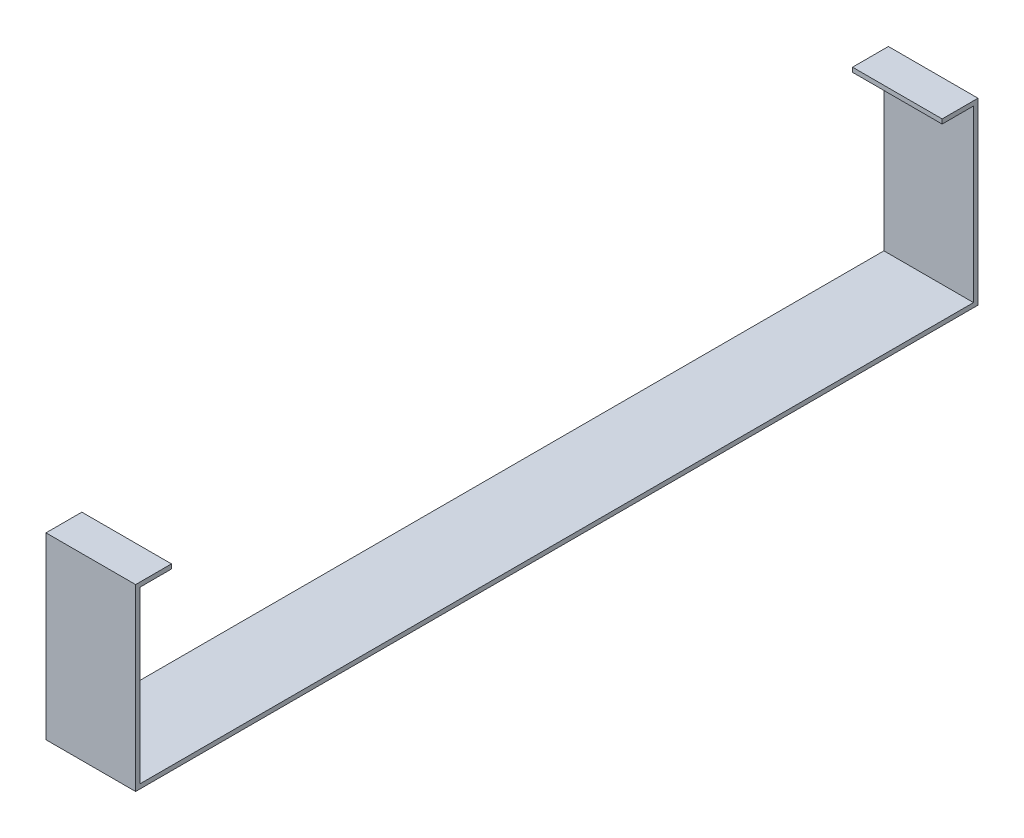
ISO-10303-21;
HEADER;
FILE_DESCRIPTION(('STEP AP214'),'2;1');
FILE_NAME('part.step','',(''),(''),'','','');
FILE_SCHEMA(('AUTOMOTIVE_DESIGN { 1 0 10303 214 1 1 1 1 }'));
ENDSEC;
DATA;
#1=APPLICATION_CONTEXT('core data for automotive mechanical design processes');
#2=APPLICATION_PROTOCOL_DEFINITION('international standard','automotive_design',2000,#1);
#3=PRODUCT_CONTEXT('',#1,'mechanical');
#4=PRODUCT('Part','Part','',(#3));
#5=PRODUCT_RELATED_PRODUCT_CATEGORY('part','',(#4));
#6=PRODUCT_DEFINITION_FORMATION('','',#4);
#7=PRODUCT_DEFINITION_CONTEXT('part definition',#1,'design');
#8=PRODUCT_DEFINITION('design','',#6,#7);
#9=PRODUCT_DEFINITION_SHAPE('','',#8);
#10=(LENGTH_UNIT() NAMED_UNIT(*) SI_UNIT(.MILLI.,.METRE.));
#11=(NAMED_UNIT(*) PLANE_ANGLE_UNIT() SI_UNIT($,.RADIAN.));
#12=(NAMED_UNIT(*) SI_UNIT($,.STERADIAN.) SOLID_ANGLE_UNIT());
#13=UNCERTAINTY_MEASURE_WITH_UNIT(LENGTH_MEASURE(1.E-05),#10,'distance_accuracy_value','');
#14=(GEOMETRIC_REPRESENTATION_CONTEXT(3) GLOBAL_UNCERTAINTY_ASSIGNED_CONTEXT((#13)) GLOBAL_UNIT_ASSIGNED_CONTEXT((#10,
#11,#12)) REPRESENTATION_CONTEXT('',''));
#15=CARTESIAN_POINT('',(0.,0.,0.));
#16=DIRECTION('',(0.,0.,1.));
#17=DIRECTION('',(1.,0.,0.));
#18=AXIS2_PLACEMENT_3D('',#15,#16,#17);
#19=CARTESIAN_POINT('',(-90.,0.,-846.));
#20=DIRECTION('',(0.,-1.,0.));
#21=DIRECTION('',(0.,0.,-1.));
#22=AXIS2_PLACEMENT_3D('',#19,#20,#21);
#23=PLANE('',#22);
#24=DIRECTION('',(0.,0.,-1.));
#25=VECTOR('',#24,1.);
#26=CARTESIAN_POINT('',(0.,0.,-846.));
#27=LINE('',#26,#25);
#28=CARTESIAN_POINT('',(0.,0.,0.));
#29=VERTEX_POINT('',#28);
#30=CARTESIAN_POINT('',(0.,0.,-846.));
#31=VERTEX_POINT('',#30);
#32=EDGE_CURVE('E153',#29,#31,#27,.T.);
#33=ORIENTED_EDGE('',*,*,#32,.F.);
#34=DIRECTION('',(1.,0.,0.));
#35=VECTOR('',#34,1.);
#36=CARTESIAN_POINT('',(-90.,0.,0.));
#37=LINE('',#36,#35);
#38=CARTESIAN_POINT('',(-90.,0.,0.));
#39=VERTEX_POINT('',#38);
#40=EDGE_CURVE('E11',#39,#29,#37,.T.);
#41=ORIENTED_EDGE('',*,*,#40,.F.);
#42=DIRECTION('',(0.,0.,-1.));
#43=VECTOR('',#42,1.);
#44=CARTESIAN_POINT('',(-90.,0.,-846.));
#45=LINE('',#44,#43);
#46=CARTESIAN_POINT('',(-90.,0.,-846.));
#47=VERTEX_POINT('',#46);
#48=EDGE_CURVE('E185',#39,#47,#45,.T.);
#49=ORIENTED_EDGE('',*,*,#48,.T.);
#50=DIRECTION('',(1.,0.,0.));
#51=VECTOR('',#50,1.);
#52=CARTESIAN_POINT('',(-90.,0.,-846.));
#53=LINE('',#52,#51);
#54=EDGE_CURVE('E35',#47,#31,#53,.T.);
#55=ORIENTED_EDGE('',*,*,#54,.T.);
#56=EDGE_LOOP('',(#33,#41,#49,#55));
#57=FACE_BOUND('',#56,.T.);
#58=ADVANCED_FACE('F32',(#57),#23,.T.);
#59=CARTESIAN_POINT('',(-90.,0.,0.));
#60=DIRECTION('',(0.,0.,1.));
#61=DIRECTION('',(1.,0.,0.));
#62=AXIS2_PLACEMENT_3D('',#59,#60,#61);
#63=PLANE('',#62);
#64=DIRECTION('',(0.,-1.,0.));
#65=VECTOR('',#64,1.);
#66=CARTESIAN_POINT('',(0.,0.,0.));
#67=LINE('',#66,#65);
#68=CARTESIAN_POINT('',(0.,180.,0.));
#69=VERTEX_POINT('',#68);
#70=EDGE_CURVE('E183',#69,#29,#67,.T.);
#71=ORIENTED_EDGE('',*,*,#70,.F.);
#72=DIRECTION('',(1.,0.,0.));
#73=VECTOR('',#72,1.);
#74=CARTESIAN_POINT('',(-90.,180.,0.));
#75=LINE('',#74,#73);
#76=CARTESIAN_POINT('',(-90.,180.,0.));
#77=VERTEX_POINT('',#76);
#78=EDGE_CURVE('E41',#77,#69,#75,.T.);
#79=ORIENTED_EDGE('',*,*,#78,.F.);
#80=DIRECTION('',(0.,-1.,0.));
#81=VECTOR('',#80,1.);
#82=CARTESIAN_POINT('',(-90.,0.,0.));
#83=LINE('',#82,#81);
#84=EDGE_CURVE('E143',#77,#39,#83,.T.);
#85=ORIENTED_EDGE('',*,*,#84,.T.);
#86=ORIENTED_EDGE('',*,*,#40,.T.);
#87=EDGE_LOOP('',(#71,#79,#85,#86));
#88=FACE_BOUND('',#87,.T.);
#89=ADVANCED_FACE('F205',(#88),#63,.T.);
#90=CARTESIAN_POINT('',(-90.,180.,0.));
#91=DIRECTION('',(0.,1.,0.));
#92=DIRECTION('',(0.,0.,1.));
#93=AXIS2_PLACEMENT_3D('',#90,#91,#92);
#94=PLANE('',#93);
#95=DIRECTION('',(0.,0.,1.));
#96=VECTOR('',#95,1.);
#97=CARTESIAN_POINT('',(0.,180.,0.));
#98=LINE('',#97,#96);
#99=CARTESIAN_POINT('',(0.,180.,-36.));
#100=VERTEX_POINT('',#99);
#101=EDGE_CURVE('E130',#100,#69,#98,.T.);
#102=ORIENTED_EDGE('',*,*,#101,.F.);
#103=DIRECTION('',(1.,0.,0.));
#104=VECTOR('',#103,1.);
#105=CARTESIAN_POINT('',(-90.,180.,-36.));
#106=LINE('',#105,#104);
#107=CARTESIAN_POINT('',(-90.,180.,-36.));
#108=VERTEX_POINT('',#107);
#109=EDGE_CURVE('E125',#108,#100,#106,.T.);
#110=ORIENTED_EDGE('',*,*,#109,.F.);
#111=DIRECTION('',(0.,0.,1.));
#112=VECTOR('',#111,1.);
#113=CARTESIAN_POINT('',(-90.,180.,0.));
#114=LINE('',#113,#112);
#115=EDGE_CURVE('E128',#108,#77,#114,.T.);
#116=ORIENTED_EDGE('',*,*,#115,.T.);
#117=ORIENTED_EDGE('',*,*,#78,.T.);
#118=EDGE_LOOP('',(#102,#110,#116,#117));
#119=FACE_BOUND('',#118,.T.);
#120=ADVANCED_FACE('F127',(#119),#94,.T.);
#121=CARTESIAN_POINT('',(-90.,180.,-36.));
#122=DIRECTION('',(0.,0.,-1.));
#123=DIRECTION('',(-1.,0.,0.));
#124=AXIS2_PLACEMENT_3D('',#121,#122,#123);
#125=PLANE('',#124);
#126=DIRECTION('',(0.,1.,0.));
#127=VECTOR('',#126,1.);
#128=CARTESIAN_POINT('',(0.,180.,-36.));
#129=LINE('',#128,#127);
#130=CARTESIAN_POINT('',(0.,175.5,-36.));
#131=VERTEX_POINT('',#130);
#132=EDGE_CURVE('E180',#131,#100,#129,.T.);
#133=ORIENTED_EDGE('',*,*,#132,.F.);
#134=DIRECTION('',(1.,0.,0.));
#135=VECTOR('',#134,1.);
#136=CARTESIAN_POINT('',(-90.,175.5,-36.));
#137=LINE('',#136,#135);
#138=CARTESIAN_POINT('',(-90.,175.5,-36.));
#139=VERTEX_POINT('',#138);
#140=EDGE_CURVE('E135',#139,#131,#137,.T.);
#141=ORIENTED_EDGE('',*,*,#140,.F.);
#142=DIRECTION('',(0.,1.,0.));
#143=VECTOR('',#142,1.);
#144=CARTESIAN_POINT('',(-90.,180.,-36.));
#145=LINE('',#144,#143);
#146=EDGE_CURVE('E141',#139,#108,#145,.T.);
#147=ORIENTED_EDGE('',*,*,#146,.T.);
#148=ORIENTED_EDGE('',*,*,#109,.T.);
#149=EDGE_LOOP('',(#133,#141,#147,#148));
#150=FACE_BOUND('',#149,.T.);
#151=ADVANCED_FACE('F145',(#150),#125,.T.);
#152=CARTESIAN_POINT('',(-90.,175.5,-36.));
#153=DIRECTION('',(0.,-1.,0.));
#154=DIRECTION('',(0.,0.,-1.));
#155=AXIS2_PLACEMENT_3D('',#152,#153,#154);
#156=PLANE('',#155);
#157=DIRECTION('',(0.,0.,-1.));
#158=VECTOR('',#157,1.);
#159=CARTESIAN_POINT('',(0.,175.5,-36.));
#160=LINE('',#159,#158);
#161=CARTESIAN_POINT('',(0.,175.5,-4.5));
#162=VERTEX_POINT('',#161);
#163=EDGE_CURVE('E177',#162,#131,#160,.T.);
#164=ORIENTED_EDGE('',*,*,#163,.F.);
#165=DIRECTION('',(1.,0.,0.));
#166=VECTOR('',#165,1.);
#167=CARTESIAN_POINT('',(-90.,175.5,-4.5));
#168=LINE('',#167,#166);
#169=CARTESIAN_POINT('',(-90.,175.5,-4.5));
#170=VERTEX_POINT('',#169);
#171=EDGE_CURVE('E189',#170,#162,#168,.T.);
#172=ORIENTED_EDGE('',*,*,#171,.F.);
#173=DIRECTION('',(0.,0.,-1.));
#174=VECTOR('',#173,1.);
#175=CARTESIAN_POINT('',(-90.,175.5,-36.));
#176=LINE('',#175,#174);
#177=EDGE_CURVE('E146',#170,#139,#176,.T.);
#178=ORIENTED_EDGE('',*,*,#177,.T.);
#179=ORIENTED_EDGE('',*,*,#140,.T.);
#180=EDGE_LOOP('',(#164,#172,#178,#179));
#181=FACE_BOUND('',#180,.T.);
#182=ADVANCED_FACE('F218',(#181),#156,.T.);
#183=CARTESIAN_POINT('',(-90.,175.5,-4.5));
#184=DIRECTION('',(0.,0.,-1.));
#185=DIRECTION('',(0.,1.,0.));
#186=AXIS2_PLACEMENT_3D('',#183,#184,#185);
#187=PLANE('',#186);
#188=DIRECTION('',(0.,1.,0.));
#189=VECTOR('',#188,1.);
#190=CARTESIAN_POINT('',(0.,175.5,-4.5));
#191=LINE('',#190,#189);
#192=CARTESIAN_POINT('',(0.,4.49999999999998,-4.50000000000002));
#193=VERTEX_POINT('',#192);
#194=EDGE_CURVE('E174',#193,#162,#191,.T.);
#195=ORIENTED_EDGE('',*,*,#194,.F.);
#196=DIRECTION('',(1.,0.,0.));
#197=VECTOR('',#196,1.);
#198=CARTESIAN_POINT('',(-90.,4.49999999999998,-4.50000000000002));
#199=LINE('',#198,#197);
#200=CARTESIAN_POINT('',(-90.,4.49999999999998,-4.50000000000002));
#201=VERTEX_POINT('',#200);
#202=EDGE_CURVE('E191',#201,#193,#199,.T.);
#203=ORIENTED_EDGE('',*,*,#202,.F.);
#204=DIRECTION('',(0.,1.,0.));
#205=VECTOR('',#204,1.);
#206=CARTESIAN_POINT('',(-90.,175.5,-4.5));
#207=LINE('',#206,#205);
#208=EDGE_CURVE('E148',#201,#170,#207,.T.);
#209=ORIENTED_EDGE('',*,*,#208,.T.);
#210=ORIENTED_EDGE('',*,*,#171,.T.);
#211=EDGE_LOOP('',(#195,#203,#209,#210));
#212=FACE_BOUND('',#211,.T.);
#213=ADVANCED_FACE('F221',(#212),#187,.T.);
#214=CARTESIAN_POINT('',(-90.,4.49999999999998,-4.50000000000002));
#215=DIRECTION('',(0.,1.,0.));
#216=DIRECTION('',(0.,0.,1.));
#217=AXIS2_PLACEMENT_3D('',#214,#215,#216);
#218=PLANE('',#217);
#219=DIRECTION('',(0.,0.,1.));
#220=VECTOR('',#219,1.);
#221=CARTESIAN_POINT('',(0.,4.49999999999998,-4.50000000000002));
#222=LINE('',#221,#220);
#223=CARTESIAN_POINT('',(0.,4.49999999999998,-841.5));
#224=VERTEX_POINT('',#223);
#225=EDGE_CURVE('E171',#224,#193,#222,.T.);
#226=ORIENTED_EDGE('',*,*,#225,.F.);
#227=DIRECTION('',(1.,0.,0.));
#228=VECTOR('',#227,1.);
#229=CARTESIAN_POINT('',(-90.,4.49999999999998,-841.5));
#230=LINE('',#229,#228);
#231=CARTESIAN_POINT('',(-90.,4.49999999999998,-841.5));
#232=VERTEX_POINT('',#231);
#233=EDGE_CURVE('E193',#232,#224,#230,.T.);
#234=ORIENTED_EDGE('',*,*,#233,.F.);
#235=DIRECTION('',(0.,0.,1.));
#236=VECTOR('',#235,1.);
#237=CARTESIAN_POINT('',(-90.,4.49999999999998,-4.50000000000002));
#238=LINE('',#237,#236);
#239=EDGE_CURVE('E347',#232,#201,#238,.T.);
#240=ORIENTED_EDGE('',*,*,#239,.T.);
#241=ORIENTED_EDGE('',*,*,#202,.T.);
#242=EDGE_LOOP('',(#226,#234,#240,#241));
#243=FACE_BOUND('',#242,.T.);
#244=ADVANCED_FACE('F225',(#243),#218,.T.);
#245=CARTESIAN_POINT('',(-90.,4.49999999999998,-841.5));
#246=DIRECTION('',(0.,0.,1.));
#247=DIRECTION('',(1.,0.,0.));
#248=AXIS2_PLACEMENT_3D('',#245,#246,#247);
#249=PLANE('',#248);
#250=DIRECTION('',(0.,-1.,0.));
#251=VECTOR('',#250,1.);
#252=CARTESIAN_POINT('',(0.,4.49999999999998,-841.5));
#253=LINE('',#252,#251);
#254=CARTESIAN_POINT('',(0.,175.5,-841.5));
#255=VERTEX_POINT('',#254);
#256=EDGE_CURVE('E168',#255,#224,#253,.T.);
#257=ORIENTED_EDGE('',*,*,#256,.F.);
#258=DIRECTION('',(1.,0.,0.));
#259=VECTOR('',#258,1.);
#260=CARTESIAN_POINT('',(-90.,175.5,-841.5));
#261=LINE('',#260,#259);
#262=CARTESIAN_POINT('',(-90.,175.5,-841.5));
#263=VERTEX_POINT('',#262);
#264=EDGE_CURVE('E195',#263,#255,#261,.T.);
#265=ORIENTED_EDGE('',*,*,#264,.F.);
#266=DIRECTION('',(0.,-1.,0.));
#267=VECTOR('',#266,1.);
#268=CARTESIAN_POINT('',(-90.,4.49999999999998,-841.5));
#269=LINE('',#268,#267);
#270=EDGE_CURVE('E351',#263,#232,#269,.T.);
#271=ORIENTED_EDGE('',*,*,#270,.T.);
#272=ORIENTED_EDGE('',*,*,#233,.T.);
#273=EDGE_LOOP('',(#257,#265,#271,#272));
#274=FACE_BOUND('',#273,.T.);
#275=ADVANCED_FACE('F229',(#274),#249,.T.);
#276=CARTESIAN_POINT('',(-90.,175.5,-841.5));
#277=DIRECTION('',(0.,-1.,0.));
#278=DIRECTION('',(0.,0.,-1.));
#279=AXIS2_PLACEMENT_3D('',#276,#277,#278);
#280=PLANE('',#279);
#281=DIRECTION('',(0.,0.,-1.));
#282=VECTOR('',#281,1.);
#283=CARTESIAN_POINT('',(0.,175.5,-841.5));
#284=LINE('',#283,#282);
#285=CARTESIAN_POINT('',(0.,175.5,-810.));
#286=VERTEX_POINT('',#285);
#287=EDGE_CURVE('E165',#286,#255,#284,.T.);
#288=ORIENTED_EDGE('',*,*,#287,.F.);
#289=DIRECTION('',(1.,0.,0.));
#290=VECTOR('',#289,1.);
#291=CARTESIAN_POINT('',(-90.,175.5,-810.));
#292=LINE('',#291,#290);
#293=CARTESIAN_POINT('',(-90.,175.5,-810.));
#294=VERTEX_POINT('',#293);
#295=EDGE_CURVE('E197',#294,#286,#292,.T.);
#296=ORIENTED_EDGE('',*,*,#295,.F.);
#297=DIRECTION('',(0.,0.,-1.));
#298=VECTOR('',#297,1.);
#299=CARTESIAN_POINT('',(-90.,175.5,-841.5));
#300=LINE('',#299,#298);
#301=EDGE_CURVE('E340',#294,#263,#300,.T.);
#302=ORIENTED_EDGE('',*,*,#301,.T.);
#303=ORIENTED_EDGE('',*,*,#264,.T.);
#304=EDGE_LOOP('',(#288,#296,#302,#303));
#305=FACE_BOUND('',#304,.T.);
#306=ADVANCED_FACE('F233',(#305),#280,.T.);
#307=CARTESIAN_POINT('',(-90.,175.5,-810.));
#308=DIRECTION('',(0.,0.,1.));
#309=DIRECTION('',(1.,0.,0.));
#310=AXIS2_PLACEMENT_3D('',#307,#308,#309);
#311=PLANE('',#310);
#312=DIRECTION('',(0.,-1.,0.));
#313=VECTOR('',#312,1.);
#314=CARTESIAN_POINT('',(0.,175.5,-810.));
#315=LINE('',#314,#313);
#316=CARTESIAN_POINT('',(0.,180.,-810.));
#317=VERTEX_POINT('',#316);
#318=EDGE_CURVE('E162',#317,#286,#315,.T.);
#319=ORIENTED_EDGE('',*,*,#318,.F.);
#320=DIRECTION('',(1.,0.,0.));
#321=VECTOR('',#320,1.);
#322=CARTESIAN_POINT('',(-90.,180.,-810.));
#323=LINE('',#322,#321);
#324=CARTESIAN_POINT('',(-90.,180.,-810.));
#325=VERTEX_POINT('',#324);
#326=EDGE_CURVE('E199',#325,#317,#323,.T.);
#327=ORIENTED_EDGE('',*,*,#326,.F.);
#328=DIRECTION('',(0.,-1.,0.));
#329=VECTOR('',#328,1.);
#330=CARTESIAN_POINT('',(-90.,175.5,-810.));
#331=LINE('',#330,#329);
#332=EDGE_CURVE('E336',#325,#294,#331,.T.);
#333=ORIENTED_EDGE('',*,*,#332,.T.);
#334=ORIENTED_EDGE('',*,*,#295,.T.);
#335=EDGE_LOOP('',(#319,#327,#333,#334));
#336=FACE_BOUND('',#335,.T.);
#337=ADVANCED_FACE('F237',(#336),#311,.T.);
#338=CARTESIAN_POINT('',(-90.,180.,-810.));
#339=DIRECTION('',(0.,1.,0.));
#340=DIRECTION('',(0.,0.,1.));
#341=AXIS2_PLACEMENT_3D('',#338,#339,#340);
#342=PLANE('',#341);
#343=DIRECTION('',(0.,0.,1.));
#344=VECTOR('',#343,1.);
#345=CARTESIAN_POINT('',(0.,180.,-810.));
#346=LINE('',#345,#344);
#347=CARTESIAN_POINT('',(0.,180.,-846.));
#348=VERTEX_POINT('',#347);
#349=EDGE_CURVE('E159',#348,#317,#346,.T.);
#350=ORIENTED_EDGE('',*,*,#349,.F.);
#351=DIRECTION('',(1.,0.,0.));
#352=VECTOR('',#351,1.);
#353=CARTESIAN_POINT('',(-90.,180.,-846.));
#354=LINE('',#353,#352);
#355=CARTESIAN_POINT('',(-90.,180.,-846.));
#356=VERTEX_POINT('',#355);
#357=EDGE_CURVE('E200',#356,#348,#354,.T.);
#358=ORIENTED_EDGE('',*,*,#357,.F.);
#359=DIRECTION('',(0.,0.,1.));
#360=VECTOR('',#359,1.);
#361=CARTESIAN_POINT('',(-90.,180.,-810.));
#362=LINE('',#361,#360);
#363=EDGE_CURVE('E357',#356,#325,#362,.T.);
#364=ORIENTED_EDGE('',*,*,#363,.T.);
#365=ORIENTED_EDGE('',*,*,#326,.T.);
#366=EDGE_LOOP('',(#350,#358,#364,#365));
#367=FACE_BOUND('',#366,.T.);
#368=ADVANCED_FACE('F241',(#367),#342,.T.);
#369=CARTESIAN_POINT('',(-90.,180.,-846.));
#370=DIRECTION('',(0.,0.,-1.));
#371=DIRECTION('',(-1.,0.,0.));
#372=AXIS2_PLACEMENT_3D('',#369,#370,#371);
#373=PLANE('',#372);
#374=DIRECTION('',(0.,1.,0.));
#375=VECTOR('',#374,1.);
#376=CARTESIAN_POINT('',(0.,180.,-846.));
#377=LINE('',#376,#375);
#378=EDGE_CURVE('E156',#31,#348,#377,.T.);
#379=ORIENTED_EDGE('',*,*,#378,.F.);
#380=ORIENTED_EDGE('',*,*,#54,.F.);
#381=DIRECTION('',(0.,1.,0.));
#382=VECTOR('',#381,1.);
#383=CARTESIAN_POINT('',(-90.,180.,-846.));
#384=LINE('',#383,#382);
#385=EDGE_CURVE('E359',#47,#356,#384,.T.);
#386=ORIENTED_EDGE('',*,*,#385,.T.);
#387=ORIENTED_EDGE('',*,*,#357,.T.);
#388=EDGE_LOOP('',(#379,#380,#386,#387));
#389=FACE_BOUND('',#388,.T.);
#390=ADVANCED_FACE('F202',(#389),#373,.T.);
#391=CARTESIAN_POINT('',(-90.,0.,0.));
#392=DIRECTION('',(-1.,0.,0.));
#393=DIRECTION('',(0.,0.,1.));
#394=AXIS2_PLACEMENT_3D('',#391,#392,#393);
#395=PLANE('',#394);
#396=ORIENTED_EDGE('',*,*,#48,.F.);
#397=ORIENTED_EDGE('',*,*,#84,.F.);
#398=ORIENTED_EDGE('',*,*,#115,.F.);
#399=ORIENTED_EDGE('',*,*,#146,.F.);
#400=ORIENTED_EDGE('',*,*,#177,.F.);
#401=ORIENTED_EDGE('',*,*,#208,.F.);
#402=ORIENTED_EDGE('',*,*,#239,.F.);
#403=ORIENTED_EDGE('',*,*,#270,.F.);
#404=ORIENTED_EDGE('',*,*,#301,.F.);
#405=ORIENTED_EDGE('',*,*,#332,.F.);
#406=ORIENTED_EDGE('',*,*,#363,.F.);
#407=ORIENTED_EDGE('',*,*,#385,.F.);
#408=EDGE_LOOP('',(#396,#397,#398,#399,#400,#401,#402,#403,#404,#405,#406,#407));
#409=FACE_BOUND('',#408,.T.);
#410=ADVANCED_FACE('F139',(#409),#395,.T.);
#411=CARTESIAN_POINT('',(0.,0.,0.));
#412=DIRECTION('',(-1.,0.,0.));
#413=DIRECTION('',(0.,0.,1.));
#414=AXIS2_PLACEMENT_3D('',#411,#412,#413);
#415=PLANE('',#414);
#416=ORIENTED_EDGE('',*,*,#32,.T.);
#417=ORIENTED_EDGE('',*,*,#378,.T.);
#418=ORIENTED_EDGE('',*,*,#349,.T.);
#419=ORIENTED_EDGE('',*,*,#318,.T.);
#420=ORIENTED_EDGE('',*,*,#287,.T.);
#421=ORIENTED_EDGE('',*,*,#256,.T.);
#422=ORIENTED_EDGE('',*,*,#225,.T.);
#423=ORIENTED_EDGE('',*,*,#194,.T.);
#424=ORIENTED_EDGE('',*,*,#163,.T.);
#425=ORIENTED_EDGE('',*,*,#132,.T.);
#426=ORIENTED_EDGE('',*,*,#101,.T.);
#427=ORIENTED_EDGE('',*,*,#70,.T.);
#428=EDGE_LOOP('',(#416,#417,#418,#419,#420,#421,#422,#423,#424,#425,#426,#427));
#429=FACE_BOUND('',#428,.T.);
#430=ADVANCED_FACE('F204',(#429),#415,.F.);
#431=CLOSED_SHELL('',(#58,#89,#120,#151,#182,#213,#244,#275,#306,#337,#368,#390,#410,#430));
#432=MANIFOLD_SOLID_BREP('B2',#431);
#433=ADVANCED_BREP_SHAPE_REPRESENTATION('',(#18,#432),#14);
#434=SHAPE_DEFINITION_REPRESENTATION(#9,#433);
ENDSEC;
END-ISO-10303-21;
